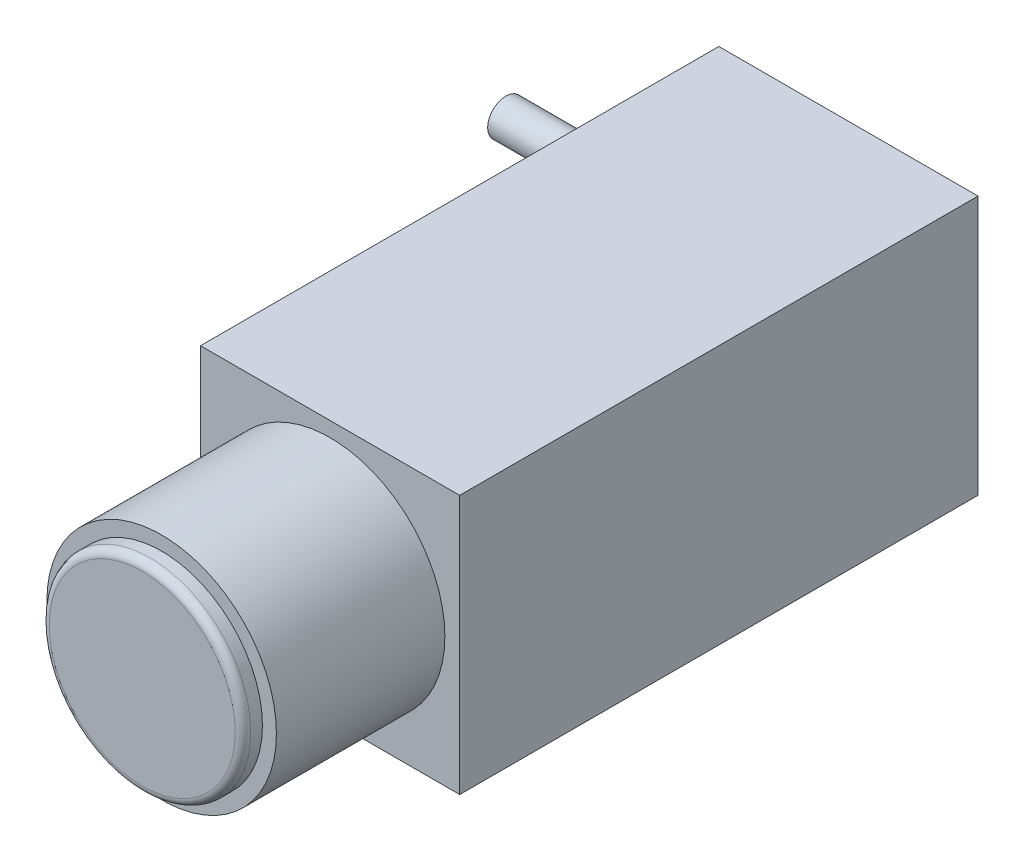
ISO-10303-21;
HEADER;
FILE_DESCRIPTION(('STEP AP214'),'2;1');
FILE_NAME('part.step','',(''),(''),'','','');
FILE_SCHEMA(('AUTOMOTIVE_DESIGN { 1 0 10303 214 1 1 1 1 }'));
ENDSEC;
DATA;
#1=APPLICATION_CONTEXT('core data for automotive mechanical design processes');
#2=APPLICATION_PROTOCOL_DEFINITION('international standard','automotive_design',2000,#1);
#3=PRODUCT_CONTEXT('',#1,'mechanical');
#4=PRODUCT('Part','Part','',(#3));
#5=PRODUCT_RELATED_PRODUCT_CATEGORY('part','',(#4));
#6=PRODUCT_DEFINITION_FORMATION('','',#4);
#7=PRODUCT_DEFINITION_CONTEXT('part definition',#1,'design');
#8=PRODUCT_DEFINITION('design','',#6,#7);
#9=PRODUCT_DEFINITION_SHAPE('','',#8);
#10=(LENGTH_UNIT() NAMED_UNIT(*) SI_UNIT(.MILLI.,.METRE.));
#11=(NAMED_UNIT(*) PLANE_ANGLE_UNIT() SI_UNIT($,.RADIAN.));
#12=(NAMED_UNIT(*) SI_UNIT($,.STERADIAN.) SOLID_ANGLE_UNIT());
#13=UNCERTAINTY_MEASURE_WITH_UNIT(LENGTH_MEASURE(1.E-05),#10,'distance_accuracy_value','');
#14=(GEOMETRIC_REPRESENTATION_CONTEXT(3) GLOBAL_UNCERTAINTY_ASSIGNED_CONTEXT((#13)) GLOBAL_UNIT_ASSIGNED_CONTEXT((#10,
#11,#12)) REPRESENTATION_CONTEXT('',''));
#15=CARTESIAN_POINT('',(0.,0.,0.));
#16=DIRECTION('',(0.,0.,1.));
#17=DIRECTION('',(1.,0.,0.));
#18=AXIS2_PLACEMENT_3D('',#15,#16,#17);
#19=CARTESIAN_POINT('',(0.,0.,50.8));
#20=DIRECTION('',(-1.,0.,0.));
#21=DIRECTION('',(0.,0.,1.));
#22=AXIS2_PLACEMENT_3D('',#19,#20,#21);
#23=PLANE('',#22);
#24=DIRECTION('',(0.,1.,0.));
#25=VECTOR('',#24,1.);
#26=CARTESIAN_POINT('',(0.,0.,0.));
#27=LINE('',#26,#25);
#28=CARTESIAN_POINT('',(0.,0.,0.));
#29=VERTEX_POINT('',#28);
#30=CARTESIAN_POINT('',(0.,25.4,0.));
#31=VERTEX_POINT('',#30);
#32=EDGE_CURVE('E116',#29,#31,#27,.T.);
#33=ORIENTED_EDGE('',*,*,#32,.T.);
#34=DIRECTION('',(0.,0.,-1.));
#35=VECTOR('',#34,1.);
#36=CARTESIAN_POINT('',(0.,25.4,50.8));
#37=LINE('',#36,#35);
#38=CARTESIAN_POINT('',(0.,25.4,50.8));
#39=VERTEX_POINT('',#38);
#40=EDGE_CURVE('E105',#39,#31,#37,.T.);
#41=ORIENTED_EDGE('',*,*,#40,.F.);
#42=DIRECTION('',(0.,1.,0.));
#43=VECTOR('',#42,1.);
#44=CARTESIAN_POINT('',(0.,0.,50.8));
#45=LINE('',#44,#43);
#46=CARTESIAN_POINT('',(0.,0.,50.8));
#47=VERTEX_POINT('',#46);
#48=EDGE_CURVE('E97',#47,#39,#45,.T.);
#49=ORIENTED_EDGE('',*,*,#48,.F.);
#50=DIRECTION('',(0.,0.,-1.));
#51=VECTOR('',#50,1.);
#52=CARTESIAN_POINT('',(0.,0.,50.8));
#53=LINE('',#52,#51);
#54=EDGE_CURVE('E112',#47,#29,#53,.T.);
#55=ORIENTED_EDGE('',*,*,#54,.T.);
#56=EDGE_LOOP('',(#33,#41,#49,#55));
#57=FACE_BOUND('',#56,.T.);
#58=ADVANCED_FACE('F43',(#57),#23,.F.);
#59=CARTESIAN_POINT('',(0.,25.4,50.8));
#60=DIRECTION('',(0.,-1.,0.));
#61=DIRECTION('',(1.,0.,0.));
#62=AXIS2_PLACEMENT_3D('',#59,#60,#61);
#63=PLANE('',#62);
#64=DIRECTION('',(-1.,0.,0.));
#65=VECTOR('',#64,1.);
#66=CARTESIAN_POINT('',(0.,25.4,0.));
#67=LINE('',#66,#65);
#68=CARTESIAN_POINT('',(-25.4,25.4,0.));
#69=VERTEX_POINT('',#68);
#70=EDGE_CURVE('E103',#31,#69,#67,.T.);
#71=ORIENTED_EDGE('',*,*,#70,.T.);
#72=DIRECTION('',(0.,0.,-1.));
#73=VECTOR('',#72,1.);
#74=CARTESIAN_POINT('',(-25.4,25.4,50.8));
#75=LINE('',#74,#73);
#76=CARTESIAN_POINT('',(-25.4,25.4,50.8));
#77=VERTEX_POINT('',#76);
#78=EDGE_CURVE('E101',#77,#69,#75,.T.);
#79=ORIENTED_EDGE('',*,*,#78,.F.);
#80=DIRECTION('',(-1.,0.,0.));
#81=VECTOR('',#80,1.);
#82=CARTESIAN_POINT('',(0.,25.4,50.8));
#83=LINE('',#82,#81);
#84=EDGE_CURVE('E92',#39,#77,#83,.T.);
#85=ORIENTED_EDGE('',*,*,#84,.F.);
#86=ORIENTED_EDGE('',*,*,#40,.T.);
#87=EDGE_LOOP('',(#71,#79,#85,#86));
#88=FACE_BOUND('',#87,.T.);
#89=ADVANCED_FACE('F102',(#88),#63,.F.);
#90=CARTESIAN_POINT('',(-25.4,0.,50.8));
#91=DIRECTION('',(1.,0.,0.));
#92=DIRECTION('',(0.,0.,-1.));
#93=AXIS2_PLACEMENT_3D('',#90,#91,#92);
#94=PLANE('',#93);
#95=CARTESIAN_POINT('',(-25.4,12.7,3.7340917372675));
#96=DIRECTION('',(1.,0.,0.));
#97=DIRECTION('',(0.,0.,-1.));
#98=AXIS2_PLACEMENT_3D('',#95,#96,#97);
#99=CIRCLE('',#98,1.778);
#100=CARTESIAN_POINT('',(-25.4,12.7,1.9560917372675));
#101=VERTEX_POINT('',#100);
#102=EDGE_CURVE('E11',#101,#101,#99,.F.);
#103=ORIENTED_EDGE('',*,*,#102,.F.);
#104=EDGE_LOOP('',(#103));
#105=FACE_BOUND('',#104,.T.);
#106=DIRECTION('',(0.,-1.,0.));
#107=VECTOR('',#106,1.);
#108=CARTESIAN_POINT('',(-25.4,0.,0.));
#109=LINE('',#108,#107);
#110=CARTESIAN_POINT('',(-25.4,0.,0.));
#111=VERTEX_POINT('',#110);
#112=EDGE_CURVE('E78',#69,#111,#109,.T.);
#113=ORIENTED_EDGE('',*,*,#112,.T.);
#114=DIRECTION('',(0.,0.,-1.));
#115=VECTOR('',#114,1.);
#116=CARTESIAN_POINT('',(-25.4,0.,50.8));
#117=LINE('',#116,#115);
#118=CARTESIAN_POINT('',(-25.4,0.,50.8));
#119=VERTEX_POINT('',#118);
#120=EDGE_CURVE('E106',#119,#111,#117,.T.);
#121=ORIENTED_EDGE('',*,*,#120,.F.);
#122=DIRECTION('',(0.,-1.,0.));
#123=VECTOR('',#122,1.);
#124=CARTESIAN_POINT('',(-25.4,0.,50.8));
#125=LINE('',#124,#123);
#126=EDGE_CURVE('E95',#77,#119,#125,.T.);
#127=ORIENTED_EDGE('',*,*,#126,.F.);
#128=ORIENTED_EDGE('',*,*,#78,.T.);
#129=EDGE_LOOP('',(#113,#121,#127,#128));
#130=FACE_BOUND('',#129,.T.);
#131=ADVANCED_FACE('F108',(#105,#130),#94,.F.);
#132=CARTESIAN_POINT('',(0.,0.,50.8));
#133=DIRECTION('',(0.,1.,0.));
#134=DIRECTION('',(0.,0.,1.));
#135=AXIS2_PLACEMENT_3D('',#132,#133,#134);
#136=PLANE('',#135);
#137=DIRECTION('',(1.,0.,0.));
#138=VECTOR('',#137,1.);
#139=CARTESIAN_POINT('',(0.,0.,0.));
#140=LINE('',#139,#138);
#141=EDGE_CURVE('E84',#111,#29,#140,.T.);
#142=ORIENTED_EDGE('',*,*,#141,.T.);
#143=ORIENTED_EDGE('',*,*,#54,.F.);
#144=DIRECTION('',(1.,0.,0.));
#145=VECTOR('',#144,1.);
#146=CARTESIAN_POINT('',(0.,0.,50.8));
#147=LINE('',#146,#145);
#148=EDGE_CURVE('E61',#119,#47,#147,.T.);
#149=ORIENTED_EDGE('',*,*,#148,.F.);
#150=ORIENTED_EDGE('',*,*,#120,.T.);
#151=EDGE_LOOP('',(#142,#143,#149,#150));
#152=FACE_BOUND('',#151,.T.);
#153=ADVANCED_FACE('F168',(#152),#136,.F.);
#154=CARTESIAN_POINT('',(0.,0.,50.8));
#155=DIRECTION('',(0.,0.,1.));
#156=DIRECTION('',(1.,0.,0.));
#157=AXIS2_PLACEMENT_3D('',#154,#155,#156);
#158=PLANE('',#157);
#159=CARTESIAN_POINT('',(-12.7,12.7,50.8));
#160=DIRECTION('',(0.,0.,1.));
#161=DIRECTION('',(1.,0.,0.));
#162=AXIS2_PLACEMENT_3D('',#159,#160,#161);
#163=CIRCLE('',#162,11.2490414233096);
#164=CARTESIAN_POINT('',(-1.45095857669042,12.7,50.8));
#165=VERTEX_POINT('',#164);
#166=EDGE_CURVE('E133',#165,#165,#163,.T.);
#167=ORIENTED_EDGE('',*,*,#166,.F.);
#168=EDGE_LOOP('',(#167));
#169=FACE_BOUND('',#168,.T.);
#170=ORIENTED_EDGE('',*,*,#48,.T.);
#171=ORIENTED_EDGE('',*,*,#84,.T.);
#172=ORIENTED_EDGE('',*,*,#126,.T.);
#173=ORIENTED_EDGE('',*,*,#148,.T.);
#174=EDGE_LOOP('',(#170,#171,#172,#173));
#175=FACE_BOUND('',#174,.T.);
#176=ADVANCED_FACE('F93',(#169,#175),#158,.T.);
#177=CARTESIAN_POINT('',(0.,0.,0.));
#178=DIRECTION('',(0.,0.,1.));
#179=DIRECTION('',(1.,0.,0.));
#180=AXIS2_PLACEMENT_3D('',#177,#178,#179);
#181=PLANE('',#180);
#182=ORIENTED_EDGE('',*,*,#32,.F.);
#183=ORIENTED_EDGE('',*,*,#141,.F.);
#184=ORIENTED_EDGE('',*,*,#112,.F.);
#185=ORIENTED_EDGE('',*,*,#70,.F.);
#186=EDGE_LOOP('',(#182,#183,#184,#185));
#187=FACE_BOUND('',#186,.T.);
#188=ADVANCED_FACE('F172',(#187),#181,.F.);
#189=CARTESIAN_POINT('',(-12.7,12.7,67.31));
#190=DIRECTION('',(0.,0.,-1.));
#191=DIRECTION('',(-1.,0.,0.));
#192=AXIS2_PLACEMENT_3D('',#189,#190,#191);
#193=CYLINDRICAL_SURFACE('',#192,11.2490414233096);
#194=CARTESIAN_POINT('',(-12.7,12.7,67.31));
#195=DIRECTION('',(0.,0.,1.));
#196=DIRECTION('',(1.,0.,0.));
#197=AXIS2_PLACEMENT_3D('',#194,#195,#196);
#198=CIRCLE('',#197,11.2490414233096);
#199=CARTESIAN_POINT('',(-1.45095857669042,12.7,67.31));
#200=VERTEX_POINT('',#199);
#201=EDGE_CURVE('E120',#200,#200,#198,.T.);
#202=ORIENTED_EDGE('',*,*,#201,.F.);
#203=EDGE_LOOP('',(#202));
#204=FACE_BOUND('',#203,.T.);
#205=ORIENTED_EDGE('',*,*,#166,.T.);
#206=EDGE_LOOP('',(#205));
#207=FACE_BOUND('',#206,.T.);
#208=ADVANCED_FACE('F175',(#204,#207),#193,.T.);
#209=CARTESIAN_POINT('',(-12.7,12.7,67.31));
#210=DIRECTION('',(0.,0.,1.));
#211=DIRECTION('',(1.,0.,0.));
#212=AXIS2_PLACEMENT_3D('',#209,#210,#211);
#213=PLANE('',#212);
#214=CARTESIAN_POINT('',(-12.7,12.7,67.31));
#215=DIRECTION('',(0.,0.,1.));
#216=DIRECTION('',(1.,0.,0.));
#217=AXIS2_PLACEMENT_3D('',#214,#215,#216);
#218=CIRCLE('',#217,9.87700280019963);
#219=CARTESIAN_POINT('',(-22.5770028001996,12.7,67.31));
#220=VERTEX_POINT('',#219);
#221=EDGE_CURVE('E137',#220,#220,#218,.T.);
#222=ORIENTED_EDGE('',*,*,#221,.F.);
#223=EDGE_LOOP('',(#222));
#224=FACE_BOUND('',#223,.T.);
#225=ORIENTED_EDGE('',*,*,#201,.T.);
#226=EDGE_LOOP('',(#225));
#227=FACE_BOUND('',#226,.T.);
#228=ADVANCED_FACE('F156',(#224,#227),#213,.T.);
#229=CARTESIAN_POINT('',(-12.7,12.7,69.215));
#230=DIRECTION('',(0.,0.,-1.));
#231=DIRECTION('',(-1.,0.,0.));
#232=AXIS2_PLACEMENT_3D('',#229,#230,#231);
#233=CYLINDRICAL_SURFACE('',#232,9.87700280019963);
#234=CARTESIAN_POINT('',(-12.7,12.7,68.453));
#235=DIRECTION('',(0.,0.,1.));
#236=DIRECTION('',(1.,0.,0.));
#237=AXIS2_PLACEMENT_3D('',#234,#235,#236);
#238=CIRCLE('',#237,9.87700280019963);
#239=CARTESIAN_POINT('',(-22.5770028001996,12.7,68.453));
#240=VERTEX_POINT('',#239);
#241=EDGE_CURVE('E53',#240,#240,#238,.F.);
#242=CARTESIAN_POINT('',(-22.5770028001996,12.7,68.453));
#243=CARTESIAN_POINT('',(-22.5770028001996,12.7,68.44109375));
#244=CARTESIAN_POINT('',(-22.5770028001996,12.7,68.4291875));
#245=CARTESIAN_POINT('',(-22.5770028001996,12.7,68.405375));
#246=CARTESIAN_POINT('',(-22.5770028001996,12.7,68.39346875));
#247=CARTESIAN_POINT('',(-22.5770028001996,12.7,68.36965625));
#248=CARTESIAN_POINT('',(-22.5770028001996,12.7,68.35775));
#249=CARTESIAN_POINT('',(-22.5770028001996,12.7,68.3339375));
#250=CARTESIAN_POINT('',(-22.5770028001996,12.7,68.32203125));
#251=CARTESIAN_POINT('',(-22.5770028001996,12.7,68.29821875));
#252=CARTESIAN_POINT('',(-22.5770028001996,12.7,68.2863125));
#253=CARTESIAN_POINT('',(-22.5770028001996,12.7,68.2625));
#254=CARTESIAN_POINT('',(-22.5770028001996,12.7,68.25059375));
#255=CARTESIAN_POINT('',(-22.5770028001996,12.7,68.22678125));
#256=CARTESIAN_POINT('',(-22.5770028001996,12.7,68.214875));
#257=CARTESIAN_POINT('',(-22.5770028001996,12.7,68.1910625));
#258=CARTESIAN_POINT('',(-22.5770028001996,12.7,68.17915625));
#259=CARTESIAN_POINT('',(-22.5770028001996,12.7,68.15534375));
#260=CARTESIAN_POINT('',(-22.5770028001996,12.7,68.1434375));
#261=CARTESIAN_POINT('',(-22.5770028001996,12.7,68.119625));
#262=CARTESIAN_POINT('',(-22.5770028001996,12.7,68.10771875));
#263=CARTESIAN_POINT('',(-22.5770028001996,12.7,68.08390625));
#264=CARTESIAN_POINT('',(-22.5770028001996,12.7,68.072));
#265=CARTESIAN_POINT('',(-22.5770028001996,12.7,68.0481875));
#266=CARTESIAN_POINT('',(-22.5770028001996,12.7,68.03628125));
#267=CARTESIAN_POINT('',(-22.5770028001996,12.7,68.01246875));
#268=CARTESIAN_POINT('',(-22.5770028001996,12.7,68.0005625));
#269=CARTESIAN_POINT('',(-22.5770028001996,12.7,67.97675));
#270=CARTESIAN_POINT('',(-22.5770028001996,12.7,67.96484375));
#271=CARTESIAN_POINT('',(-22.5770028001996,12.7,67.94103125));
#272=CARTESIAN_POINT('',(-22.5770028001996,12.7,67.929125));
#273=CARTESIAN_POINT('',(-22.5770028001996,12.7,67.9053125));
#274=CARTESIAN_POINT('',(-22.5770028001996,12.7,67.89340625));
#275=CARTESIAN_POINT('',(-22.5770028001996,12.7,67.86959375));
#276=CARTESIAN_POINT('',(-22.5770028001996,12.7,67.8576875));
#277=CARTESIAN_POINT('',(-22.5770028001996,12.7,67.833875));
#278=CARTESIAN_POINT('',(-22.5770028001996,12.7,67.82196875));
#279=CARTESIAN_POINT('',(-22.5770028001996,12.7,67.79815625));
#280=CARTESIAN_POINT('',(-22.5770028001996,12.7,67.78625));
#281=CARTESIAN_POINT('',(-22.5770028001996,12.7,67.7624375));
#282=CARTESIAN_POINT('',(-22.5770028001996,12.7,67.75053125));
#283=CARTESIAN_POINT('',(-22.5770028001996,12.7,67.72671875));
#284=CARTESIAN_POINT('',(-22.5770028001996,12.7,67.7148125));
#285=CARTESIAN_POINT('',(-22.5770028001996,12.7,67.691));
#286=CARTESIAN_POINT('',(-22.5770028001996,12.7,67.67909375));
#287=CARTESIAN_POINT('',(-22.5770028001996,12.7,67.65528125));
#288=CARTESIAN_POINT('',(-22.5770028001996,12.7,67.643375));
#289=CARTESIAN_POINT('',(-22.5770028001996,12.7,67.6195625));
#290=CARTESIAN_POINT('',(-22.5770028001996,12.7,67.60765625));
#291=CARTESIAN_POINT('',(-22.5770028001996,12.7,67.58384375));
#292=CARTESIAN_POINT('',(-22.5770028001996,12.7,67.5719375));
#293=CARTESIAN_POINT('',(-22.5770028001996,12.7,67.548125));
#294=CARTESIAN_POINT('',(-22.5770028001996,12.7,67.53621875));
#295=CARTESIAN_POINT('',(-22.5770028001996,12.7,67.51240625));
#296=CARTESIAN_POINT('',(-22.5770028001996,12.7,67.5005));
#297=CARTESIAN_POINT('',(-22.5770028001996,12.7,67.4766875));
#298=CARTESIAN_POINT('',(-22.5770028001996,12.7,67.46478125));
#299=CARTESIAN_POINT('',(-22.5770028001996,12.7,67.44096875));
#300=CARTESIAN_POINT('',(-22.5770028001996,12.7,67.4290625));
#301=CARTESIAN_POINT('',(-22.5770028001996,12.7,67.40525));
#302=CARTESIAN_POINT('',(-22.5770028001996,12.7,67.39334375));
#303=CARTESIAN_POINT('',(-22.5770028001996,12.7,67.36953125));
#304=CARTESIAN_POINT('',(-22.5770028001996,12.7,67.357625));
#305=CARTESIAN_POINT('',(-22.5770028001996,12.7,67.3338125));
#306=CARTESIAN_POINT('',(-22.5770028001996,12.7,67.32190625));
#307=CARTESIAN_POINT('',(-22.5770028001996,12.7,67.31));
#308=B_SPLINE_CURVE_WITH_KNOTS('',3,(#242,#243,#244,#245,#246,#247,#248,#249,#250,#251,#252,
#253,#254,#255,#256,#257,#258,#259,#260,#261,#262,#263,#264,#265,#266,#267,#268,#269,#270,#271,
#272,#273,#274,#275,#276,#277,#278,#279,#280,#281,#282,#283,#284,#285,#286,#287,#288,#289,#290,
#291,#292,#293,#294,#295,#296,#297,#298,#299,#300,#301,#302,#303,#304,#305,#306,#307),
.UNSPECIFIED.,.F.,.F.,(4,2,2,2,2,2,2,2,2,2,2,2,2,2,2,2,2,2,2,2,2,2,2,2,2,2,2,2,2,2,2,2,4),(0.,
0.0357187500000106,0.0714375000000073,0.107156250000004,0.142875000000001,0.178593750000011,
0.214312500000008,0.250031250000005,0.285750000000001,0.321468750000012,0.357187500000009,
0.392906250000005,0.428625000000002,0.464343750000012,0.500062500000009,0.535781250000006,
0.571500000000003,0.607218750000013,0.64293750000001,0.678656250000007,0.714375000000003,
0.750093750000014,0.78581250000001,0.821531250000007,0.857250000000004,0.892968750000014,
0.928687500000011,0.964406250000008,1.000125,1.03584375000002,1.07156250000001,1.10728125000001,
1.14300000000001),.UNSPECIFIED.);
#309=EDGE_CURVE('BSEAM142',#240,#220,#308,.T.);
#310=ORIENTED_EDGE('',*,*,#241,.T.);
#311=ORIENTED_EDGE('',*,*,#221,.T.);
#312=ORIENTED_EDGE('',*,*,#309,.T.);
#313=ORIENTED_EDGE('',*,*,#309,.F.);
#314=EDGE_LOOP('',(#310,#312,#311,#313));
#315=FACE_BOUND('',#314,.T.);
#316=ADVANCED_FACE('F142',(#315),#233,.T.);
#317=CARTESIAN_POINT('',(-12.7,12.7,69.215));
#318=DIRECTION('',(0.,0.,1.));
#319=DIRECTION('',(1.,0.,0.));
#320=AXIS2_PLACEMENT_3D('',#317,#318,#319);
#321=PLANE('',#320);
#322=CARTESIAN_POINT('',(-12.7,12.7,69.215));
#323=DIRECTION('',(0.,0.,1.));
#324=DIRECTION('',(1.,0.,0.));
#325=AXIS2_PLACEMENT_3D('',#322,#323,#324);
#326=CIRCLE('',#325,9.11500280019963);
#327=CARTESIAN_POINT('',(-3.58499719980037,12.7,69.215));
#328=VERTEX_POINT('',#327);
#329=EDGE_CURVE('E134',#328,#328,#326,.T.);
#330=ORIENTED_EDGE('',*,*,#329,.T.);
#331=EDGE_LOOP('',(#330));
#332=FACE_BOUND('',#331,.T.);
#333=ADVANCED_FACE('F148',(#332),#321,.T.);
#334=CARTESIAN_POINT('',(-12.7,12.7,68.453));
#335=DIRECTION('',(0.,0.,1.));
#336=DIRECTION('',(1.,0.,0.));
#337=AXIS2_PLACEMENT_3D('',#334,#335,#336);
#338=TOROIDAL_SURFACE('',#337,9.11500280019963,0.762);
#339=ORIENTED_EDGE('',*,*,#241,.F.);
#340=EDGE_LOOP('',(#339));
#341=FACE_BOUND('',#340,.T.);
#342=ORIENTED_EDGE('',*,*,#329,.F.);
#343=EDGE_LOOP('',(#342));
#344=FACE_BOUND('',#343,.T.);
#345=ADVANCED_FACE('F45',(#341,#344),#338,.T.);
#346=CARTESIAN_POINT('',(-42.545,12.7,3.7340917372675));
#347=DIRECTION('',(1.,0.,0.));
#348=DIRECTION('',(0.,0.,-1.));
#349=AXIS2_PLACEMENT_3D('',#346,#347,#348);
#350=CYLINDRICAL_SURFACE('',#349,1.778);
#351=CARTESIAN_POINT('',(-42.545,12.7,3.7340917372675));
#352=DIRECTION('',(-1.,0.,0.));
#353=DIRECTION('',(0.,0.,1.));
#354=AXIS2_PLACEMENT_3D('',#351,#352,#353);
#355=CIRCLE('',#354,1.778);
#356=CARTESIAN_POINT('',(-42.545,12.7,5.5120917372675));
#357=VERTEX_POINT('',#356);
#358=EDGE_CURVE('E193',#357,#357,#355,.T.);
#359=ORIENTED_EDGE('',*,*,#358,.F.);
#360=EDGE_LOOP('',(#359));
#361=FACE_BOUND('',#360,.T.);
#362=ORIENTED_EDGE('',*,*,#102,.T.);
#363=EDGE_LOOP('',(#362));
#364=FACE_BOUND('',#363,.T.);
#365=ADVANCED_FACE('F147',(#361,#364),#350,.T.);
#366=CARTESIAN_POINT('',(-42.545,12.7,3.7340917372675));
#367=DIRECTION('',(-1.,0.,0.));
#368=DIRECTION('',(0.,0.,1.));
#369=AXIS2_PLACEMENT_3D('',#366,#367,#368);
#370=PLANE('',#369);
#371=ORIENTED_EDGE('',*,*,#358,.T.);
#372=EDGE_LOOP('',(#371));
#373=FACE_BOUND('',#372,.T.);
#374=ADVANCED_FACE('F208',(#373),#370,.T.);
#375=CLOSED_SHELL('',(#58,#89,#131,#153,#176,#188,#208,#228,#316,#333,#345,#365,#374));
#376=MANIFOLD_SOLID_BREP('B2',#375);
#377=ADVANCED_BREP_SHAPE_REPRESENTATION('',(#18,#376),#14);
#378=SHAPE_DEFINITION_REPRESENTATION(#9,#377);
ENDSEC;
END-ISO-10303-21;
